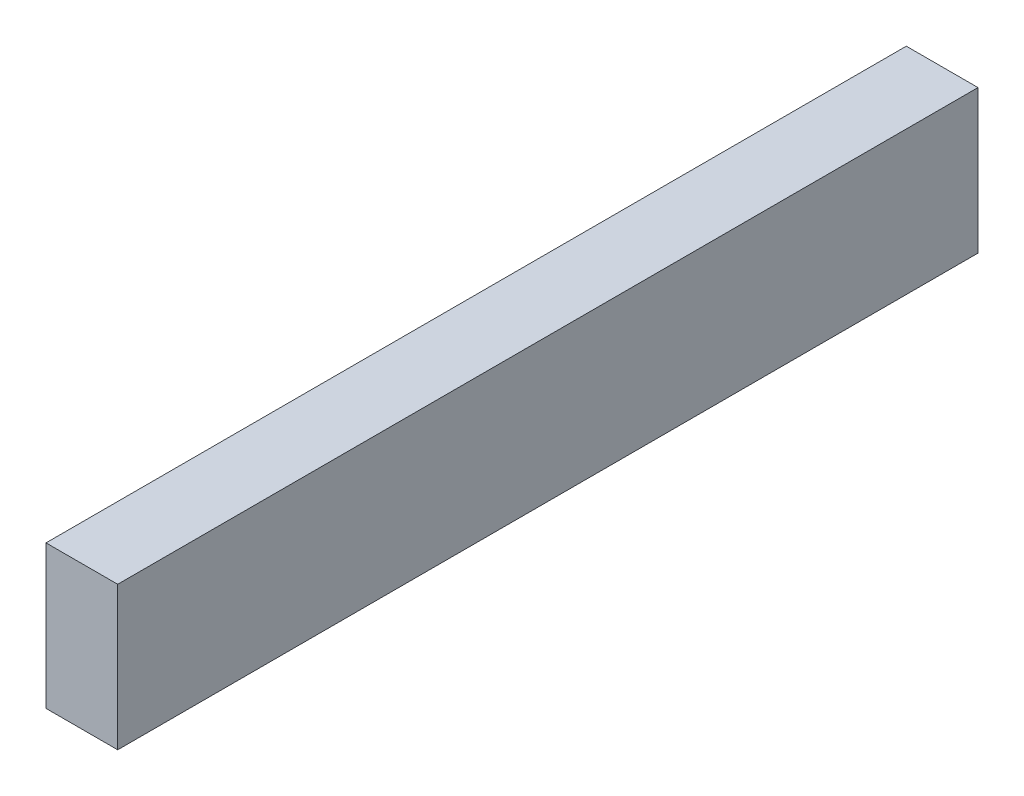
ISO-10303-21;
HEADER;
FILE_DESCRIPTION(('STEP AP214'),'2;1');
FILE_NAME('part.step','',(''),(''),'','','');
FILE_SCHEMA(('AUTOMOTIVE_DESIGN { 1 0 10303 214 1 1 1 1 }'));
ENDSEC;
DATA;
#1=APPLICATION_CONTEXT('core data for automotive mechanical design processes');
#2=APPLICATION_PROTOCOL_DEFINITION('international standard','automotive_design',2000,#1);
#3=PRODUCT_CONTEXT('',#1,'mechanical');
#4=PRODUCT('Part','Part','',(#3));
#5=PRODUCT_RELATED_PRODUCT_CATEGORY('part','',(#4));
#6=PRODUCT_DEFINITION_FORMATION('','',#4);
#7=PRODUCT_DEFINITION_CONTEXT('part definition',#1,'design');
#8=PRODUCT_DEFINITION('design','',#6,#7);
#9=PRODUCT_DEFINITION_SHAPE('','',#8);
#10=(LENGTH_UNIT() NAMED_UNIT(*) SI_UNIT(.MILLI.,.METRE.));
#11=(NAMED_UNIT(*) PLANE_ANGLE_UNIT() SI_UNIT($,.RADIAN.));
#12=(NAMED_UNIT(*) SI_UNIT($,.STERADIAN.) SOLID_ANGLE_UNIT());
#13=UNCERTAINTY_MEASURE_WITH_UNIT(LENGTH_MEASURE(1.E-05),#10,'distance_accuracy_value','');
#14=(GEOMETRIC_REPRESENTATION_CONTEXT(3) GLOBAL_UNCERTAINTY_ASSIGNED_CONTEXT((#13)) GLOBAL_UNIT_ASSIGNED_CONTEXT((#10,
#11,#12)) REPRESENTATION_CONTEXT('',''));
#15=CARTESIAN_POINT('',(0.,0.,0.));
#16=DIRECTION('',(0.,0.,1.));
#17=DIRECTION('',(1.,0.,0.));
#18=AXIS2_PLACEMENT_3D('',#15,#16,#17);
#19=CARTESIAN_POINT('',(-2.5,5.,30.));
#20=DIRECTION('',(1.,0.,0.));
#21=DIRECTION('',(0.,0.,-1.));
#22=AXIS2_PLACEMENT_3D('',#19,#20,#21);
#23=PLANE('',#22);
#24=DIRECTION('',(0.,-1.,0.));
#25=VECTOR('',#24,1.);
#26=CARTESIAN_POINT('',(-2.5,5.,-30.));
#27=LINE('',#26,#25);
#28=CARTESIAN_POINT('',(-2.5,5.,-30.));
#29=VERTEX_POINT('',#28);
#30=CARTESIAN_POINT('',(-2.5,-5.,-30.));
#31=VERTEX_POINT('',#30);
#32=EDGE_CURVE('E70',#29,#31,#27,.T.);
#33=ORIENTED_EDGE('',*,*,#32,.T.);
#34=DIRECTION('',(0.,0.,-1.));
#35=VECTOR('',#34,1.);
#36=CARTESIAN_POINT('',(-2.5,-5.,30.));
#37=LINE('',#36,#35);
#38=CARTESIAN_POINT('',(-2.5,-5.,30.));
#39=VERTEX_POINT('',#38);
#40=EDGE_CURVE('E11',#39,#31,#37,.T.);
#41=ORIENTED_EDGE('',*,*,#40,.F.);
#42=DIRECTION('',(0.,-1.,0.));
#43=VECTOR('',#42,1.);
#44=CARTESIAN_POINT('',(-2.5,5.,30.));
#45=LINE('',#44,#43);
#46=CARTESIAN_POINT('',(-2.5,5.,30.));
#47=VERTEX_POINT('',#46);
#48=EDGE_CURVE('E88',#47,#39,#45,.T.);
#49=ORIENTED_EDGE('',*,*,#48,.F.);
#50=DIRECTION('',(0.,0.,-1.));
#51=VECTOR('',#50,1.);
#52=CARTESIAN_POINT('',(-2.5,5.,30.));
#53=LINE('',#52,#51);
#54=EDGE_CURVE('E82',#47,#29,#53,.T.);
#55=ORIENTED_EDGE('',*,*,#54,.T.);
#56=EDGE_LOOP('',(#33,#41,#49,#55));
#57=FACE_BOUND('',#56,.T.);
#58=ADVANCED_FACE('F26',(#57),#23,.F.);
#59=CARTESIAN_POINT('',(-2.5,-5.,30.));
#60=DIRECTION('',(0.,1.,0.));
#61=DIRECTION('',(0.,0.,1.));
#62=AXIS2_PLACEMENT_3D('',#59,#60,#61);
#63=PLANE('',#62);
#64=DIRECTION('',(1.,0.,0.));
#65=VECTOR('',#64,1.);
#66=CARTESIAN_POINT('',(-2.5,-5.,-30.));
#67=LINE('',#66,#65);
#68=CARTESIAN_POINT('',(2.5,-5.,-30.));
#69=VERTEX_POINT('',#68);
#70=EDGE_CURVE('E66',#31,#69,#67,.T.);
#71=ORIENTED_EDGE('',*,*,#70,.T.);
#72=DIRECTION('',(0.,0.,-1.));
#73=VECTOR('',#72,1.);
#74=CARTESIAN_POINT('',(2.5,-5.,30.));
#75=LINE('',#74,#73);
#76=CARTESIAN_POINT('',(2.5,-5.,30.));
#77=VERTEX_POINT('',#76);
#78=EDGE_CURVE('E33',#77,#69,#75,.T.);
#79=ORIENTED_EDGE('',*,*,#78,.F.);
#80=DIRECTION('',(1.,0.,0.));
#81=VECTOR('',#80,1.);
#82=CARTESIAN_POINT('',(-2.5,-5.,30.));
#83=LINE('',#82,#81);
#84=EDGE_CURVE('E78',#39,#77,#83,.T.);
#85=ORIENTED_EDGE('',*,*,#84,.F.);
#86=ORIENTED_EDGE('',*,*,#40,.T.);
#87=EDGE_LOOP('',(#71,#79,#85,#86));
#88=FACE_BOUND('',#87,.T.);
#89=ADVANCED_FACE('F77',(#88),#63,.F.);
#90=CARTESIAN_POINT('',(2.5,5.,30.));
#91=DIRECTION('',(-1.,0.,0.));
#92=DIRECTION('',(0.,0.,1.));
#93=AXIS2_PLACEMENT_3D('',#90,#91,#92);
#94=PLANE('',#93);
#95=DIRECTION('',(0.,1.,0.));
#96=VECTOR('',#95,1.);
#97=CARTESIAN_POINT('',(2.5,5.,-30.));
#98=LINE('',#97,#96);
#99=CARTESIAN_POINT('',(2.5,5.,-30.));
#100=VERTEX_POINT('',#99);
#101=EDGE_CURVE('E71',#69,#100,#98,.T.);
#102=ORIENTED_EDGE('',*,*,#101,.T.);
#103=DIRECTION('',(0.,0.,-1.));
#104=VECTOR('',#103,1.);
#105=CARTESIAN_POINT('',(2.5,5.,30.));
#106=LINE('',#105,#104);
#107=CARTESIAN_POINT('',(2.5,5.,30.));
#108=VERTEX_POINT('',#107);
#109=EDGE_CURVE('E94',#108,#100,#106,.T.);
#110=ORIENTED_EDGE('',*,*,#109,.F.);
#111=DIRECTION('',(0.,1.,0.));
#112=VECTOR('',#111,1.);
#113=CARTESIAN_POINT('',(2.5,5.,30.));
#114=LINE('',#113,#112);
#115=EDGE_CURVE('E45',#77,#108,#114,.T.);
#116=ORIENTED_EDGE('',*,*,#115,.F.);
#117=ORIENTED_EDGE('',*,*,#78,.T.);
#118=EDGE_LOOP('',(#102,#110,#116,#117));
#119=FACE_BOUND('',#118,.T.);
#120=ADVANCED_FACE('F97',(#119),#94,.F.);
#121=CARTESIAN_POINT('',(-2.5,5.,30.));
#122=DIRECTION('',(0.,-1.,0.));
#123=DIRECTION('',(0.,0.,-1.));
#124=AXIS2_PLACEMENT_3D('',#121,#122,#123);
#125=PLANE('',#124);
#126=DIRECTION('',(-1.,0.,0.));
#127=VECTOR('',#126,1.);
#128=CARTESIAN_POINT('',(-2.5,5.,-30.));
#129=LINE('',#128,#127);
#130=EDGE_CURVE('E86',#100,#29,#129,.T.);
#131=ORIENTED_EDGE('',*,*,#130,.T.);
#132=ORIENTED_EDGE('',*,*,#54,.F.);
#133=DIRECTION('',(-1.,0.,0.));
#134=VECTOR('',#133,1.);
#135=CARTESIAN_POINT('',(-2.5,5.,30.));
#136=LINE('',#135,#134);
#137=EDGE_CURVE('E40',#108,#47,#136,.T.);
#138=ORIENTED_EDGE('',*,*,#137,.F.);
#139=ORIENTED_EDGE('',*,*,#109,.T.);
#140=EDGE_LOOP('',(#131,#132,#138,#139));
#141=FACE_BOUND('',#140,.T.);
#142=ADVANCED_FACE('F99',(#141),#125,.F.);
#143=CARTESIAN_POINT('',(-2.5,-5.,30.));
#144=DIRECTION('',(0.,0.,1.));
#145=DIRECTION('',(1.,0.,0.));
#146=AXIS2_PLACEMENT_3D('',#143,#144,#145);
#147=PLANE('',#146);
#148=ORIENTED_EDGE('',*,*,#48,.T.);
#149=ORIENTED_EDGE('',*,*,#84,.T.);
#150=ORIENTED_EDGE('',*,*,#115,.T.);
#151=ORIENTED_EDGE('',*,*,#137,.T.);
#152=EDGE_LOOP('',(#148,#149,#150,#151));
#153=FACE_BOUND('',#152,.T.);
#154=ADVANCED_FACE('F100',(#153),#147,.T.);
#155=CARTESIAN_POINT('',(-2.5,-5.,-30.));
#156=DIRECTION('',(0.,0.,1.));
#157=DIRECTION('',(1.,0.,0.));
#158=AXIS2_PLACEMENT_3D('',#155,#156,#157);
#159=PLANE('',#158);
#160=ORIENTED_EDGE('',*,*,#32,.F.);
#161=ORIENTED_EDGE('',*,*,#130,.F.);
#162=ORIENTED_EDGE('',*,*,#101,.F.);
#163=ORIENTED_EDGE('',*,*,#70,.F.);
#164=EDGE_LOOP('',(#160,#161,#162,#163));
#165=FACE_BOUND('',#164,.T.);
#166=ADVANCED_FACE('F67',(#165),#159,.F.);
#167=CLOSED_SHELL('',(#58,#89,#120,#142,#154,#166));
#168=MANIFOLD_SOLID_BREP('B2',#167);
#169=ADVANCED_BREP_SHAPE_REPRESENTATION('',(#18,#168),#14);
#170=SHAPE_DEFINITION_REPRESENTATION(#9,#169);
ENDSEC;
END-ISO-10303-21;
